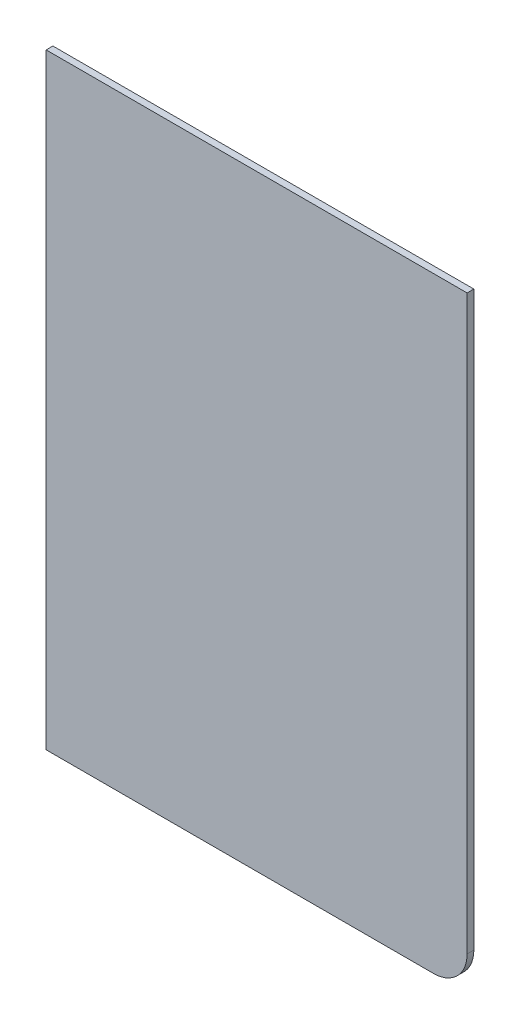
ISO-10303-21;
HEADER;
FILE_DESCRIPTION(('STEP AP214'),'2;1');
FILE_NAME('part.step','',(''),(''),'','','');
FILE_SCHEMA(('AUTOMOTIVE_DESIGN { 1 0 10303 214 1 1 1 1 }'));
ENDSEC;
DATA;
#1=APPLICATION_CONTEXT('core data for automotive mechanical design processes');
#2=APPLICATION_PROTOCOL_DEFINITION('international standard','automotive_design',2000,#1);
#3=PRODUCT_CONTEXT('',#1,'mechanical');
#4=PRODUCT('Part','Part','',(#3));
#5=PRODUCT_RELATED_PRODUCT_CATEGORY('part','',(#4));
#6=PRODUCT_DEFINITION_FORMATION('','',#4);
#7=PRODUCT_DEFINITION_CONTEXT('part definition',#1,'design');
#8=PRODUCT_DEFINITION('design','',#6,#7);
#9=PRODUCT_DEFINITION_SHAPE('','',#8);
#10=(LENGTH_UNIT() NAMED_UNIT(*) SI_UNIT(.MILLI.,.METRE.));
#11=(NAMED_UNIT(*) PLANE_ANGLE_UNIT() SI_UNIT($,.RADIAN.));
#12=(NAMED_UNIT(*) SI_UNIT($,.STERADIAN.) SOLID_ANGLE_UNIT());
#13=UNCERTAINTY_MEASURE_WITH_UNIT(LENGTH_MEASURE(1.E-05),#10,'distance_accuracy_value','');
#14=(GEOMETRIC_REPRESENTATION_CONTEXT(3) GLOBAL_UNCERTAINTY_ASSIGNED_CONTEXT((#13)) GLOBAL_UNIT_ASSIGNED_CONTEXT((#10,
#11,#12)) REPRESENTATION_CONTEXT('',''));
#15=CARTESIAN_POINT('',(0.,0.,0.));
#16=DIRECTION('',(0.,0.,1.));
#17=DIRECTION('',(1.,0.,0.));
#18=AXIS2_PLACEMENT_3D('',#15,#16,#17);
#19=CARTESIAN_POINT('',(0.,0.,2.));
#20=DIRECTION('',(1.,0.,0.));
#21=DIRECTION('',(0.,1.,0.));
#22=AXIS2_PLACEMENT_3D('',#19,#20,#21);
#23=PLANE('',#22);
#24=DIRECTION('',(0.,-1.,0.));
#25=VECTOR('',#24,1.);
#26=CARTESIAN_POINT('',(0.,0.,0.));
#27=LINE('',#26,#25);
#28=CARTESIAN_POINT('',(0.,180.,0.));
#29=VERTEX_POINT('',#28);
#30=CARTESIAN_POINT('',(0.,0.,0.));
#31=VERTEX_POINT('',#30);
#32=EDGE_CURVE('E97',#29,#31,#27,.T.);
#33=ORIENTED_EDGE('',*,*,#32,.T.);
#34=DIRECTION('',(0.,0.,-1.));
#35=VECTOR('',#34,1.);
#36=CARTESIAN_POINT('',(0.,0.,2.));
#37=LINE('',#36,#35);
#38=CARTESIAN_POINT('',(0.,0.,2.));
#39=VERTEX_POINT('',#38);
#40=EDGE_CURVE('E80',#39,#31,#37,.T.);
#41=ORIENTED_EDGE('',*,*,#40,.F.);
#42=DIRECTION('',(0.,-1.,0.));
#43=VECTOR('',#42,1.);
#44=CARTESIAN_POINT('',(0.,0.,2.));
#45=LINE('',#44,#43);
#46=CARTESIAN_POINT('',(0.,180.,2.));
#47=VERTEX_POINT('',#46);
#48=EDGE_CURVE('E85',#47,#39,#45,.T.);
#49=ORIENTED_EDGE('',*,*,#48,.F.);
#50=DIRECTION('',(0.,0.,-1.));
#51=VECTOR('',#50,1.);
#52=CARTESIAN_POINT('',(0.,180.,2.));
#53=LINE('',#52,#51);
#54=EDGE_CURVE('E104',#47,#29,#53,.T.);
#55=ORIENTED_EDGE('',*,*,#54,.T.);
#56=EDGE_LOOP('',(#33,#41,#49,#55));
#57=FACE_BOUND('',#56,.T.);
#58=ADVANCED_FACE('F33',(#57),#23,.F.);
#59=CARTESIAN_POINT('',(0.,0.,2.));
#60=DIRECTION('',(0.,1.,0.));
#61=DIRECTION('',(0.,0.,1.));
#62=AXIS2_PLACEMENT_3D('',#59,#60,#61);
#63=PLANE('',#62);
#64=DIRECTION('',(1.,0.,0.));
#65=VECTOR('',#64,1.);
#66=CARTESIAN_POINT('',(0.,0.,0.));
#67=LINE('',#66,#65);
#68=CARTESIAN_POINT('',(115.,0.,0.));
#69=VERTEX_POINT('',#68);
#70=EDGE_CURVE('E112',#31,#69,#67,.T.);
#71=ORIENTED_EDGE('',*,*,#70,.T.);
#72=DIRECTION('',(0.,0.,-1.));
#73=VECTOR('',#72,1.);
#74=CARTESIAN_POINT('',(115.,0.,2.));
#75=LINE('',#74,#73);
#76=CARTESIAN_POINT('',(115.,0.,2.));
#77=VERTEX_POINT('',#76);
#78=EDGE_CURVE('E41',#69,#77,#75,.F.);
#79=ORIENTED_EDGE('',*,*,#78,.T.);
#80=DIRECTION('',(1.,0.,0.));
#81=VECTOR('',#80,1.);
#82=CARTESIAN_POINT('',(0.,0.,2.));
#83=LINE('',#82,#81);
#84=EDGE_CURVE('E76',#39,#77,#83,.T.);
#85=ORIENTED_EDGE('',*,*,#84,.F.);
#86=ORIENTED_EDGE('',*,*,#40,.T.);
#87=EDGE_LOOP('',(#71,#79,#85,#86));
#88=FACE_BOUND('',#87,.T.);
#89=ADVANCED_FACE('F78',(#88),#63,.F.);
#90=CARTESIAN_POINT('',(125.,0.,2.));
#91=DIRECTION('',(-1.,0.,0.));
#92=DIRECTION('',(0.,-1.,0.));
#93=AXIS2_PLACEMENT_3D('',#90,#91,#92);
#94=PLANE('',#93);
#95=DIRECTION('',(0.,1.,0.));
#96=VECTOR('',#95,1.);
#97=CARTESIAN_POINT('',(125.,0.,2.));
#98=LINE('',#97,#96);
#99=CARTESIAN_POINT('',(125.,10.,2.));
#100=VERTEX_POINT('',#99);
#101=CARTESIAN_POINT('',(125.,180.,2.));
#102=VERTEX_POINT('',#101);
#103=EDGE_CURVE('E84',#100,#102,#98,.T.);
#104=ORIENTED_EDGE('',*,*,#103,.F.);
#105=DIRECTION('',(0.,0.,-1.));
#106=VECTOR('',#105,1.);
#107=CARTESIAN_POINT('',(125.,10.,2.));
#108=LINE('',#107,#106);
#109=CARTESIAN_POINT('',(125.,10.,0.));
#110=VERTEX_POINT('',#109);
#111=EDGE_CURVE('E98',#100,#110,#108,.T.);
#112=ORIENTED_EDGE('',*,*,#111,.T.);
#113=DIRECTION('',(0.,1.,0.));
#114=VECTOR('',#113,1.);
#115=CARTESIAN_POINT('',(125.,0.,0.));
#116=LINE('',#115,#114);
#117=CARTESIAN_POINT('',(125.,180.,0.));
#118=VERTEX_POINT('',#117);
#119=EDGE_CURVE('E110',#110,#118,#116,.T.);
#120=ORIENTED_EDGE('',*,*,#119,.T.);
#121=DIRECTION('',(0.,0.,-1.));
#122=VECTOR('',#121,1.);
#123=CARTESIAN_POINT('',(125.,180.,2.));
#124=LINE('',#123,#122);
#125=EDGE_CURVE('E99',#102,#118,#124,.T.);
#126=ORIENTED_EDGE('',*,*,#125,.F.);
#127=EDGE_LOOP('',(#104,#112,#120,#126));
#128=FACE_BOUND('',#127,.T.);
#129=ADVANCED_FACE('F120',(#128),#94,.F.);
#130=CARTESIAN_POINT('',(0.,180.,2.));
#131=DIRECTION('',(0.,-1.,0.));
#132=DIRECTION('',(0.,0.,-1.));
#133=AXIS2_PLACEMENT_3D('',#130,#131,#132);
#134=PLANE('',#133);
#135=DIRECTION('',(-1.,0.,0.));
#136=VECTOR('',#135,1.);
#137=CARTESIAN_POINT('',(0.,180.,0.));
#138=LINE('',#137,#136);
#139=EDGE_CURVE('E94',#118,#29,#138,.T.);
#140=ORIENTED_EDGE('',*,*,#139,.T.);
#141=ORIENTED_EDGE('',*,*,#54,.F.);
#142=DIRECTION('',(-1.,0.,0.));
#143=VECTOR('',#142,1.);
#144=CARTESIAN_POINT('',(0.,180.,2.));
#145=LINE('',#144,#143);
#146=EDGE_CURVE('E90',#102,#47,#145,.T.);
#147=ORIENTED_EDGE('',*,*,#146,.F.);
#148=ORIENTED_EDGE('',*,*,#125,.T.);
#149=EDGE_LOOP('',(#140,#141,#147,#148));
#150=FACE_BOUND('',#149,.T.);
#151=ADVANCED_FACE('F123',(#150),#134,.F.);
#152=CARTESIAN_POINT('',(0.,180.,2.));
#153=DIRECTION('',(0.,0.,-1.));
#154=DIRECTION('',(-1.,0.,0.));
#155=AXIS2_PLACEMENT_3D('',#152,#153,#154);
#156=PLANE('',#155);
#157=ORIENTED_EDGE('',*,*,#84,.T.);
#158=CARTESIAN_POINT('',(115.,10.,2.));
#159=DIRECTION('',(0.,0.,-1.));
#160=DIRECTION('',(-1.,0.,0.));
#161=AXIS2_PLACEMENT_3D('',#158,#159,#160);
#162=CIRCLE('',#161,10.);
#163=EDGE_CURVE('E11',#77,#100,#162,.F.);
#164=ORIENTED_EDGE('',*,*,#163,.T.);
#165=ORIENTED_EDGE('',*,*,#103,.T.);
#166=ORIENTED_EDGE('',*,*,#146,.T.);
#167=ORIENTED_EDGE('',*,*,#48,.T.);
#168=EDGE_LOOP('',(#157,#164,#165,#166,#167));
#169=FACE_BOUND('',#168,.T.);
#170=ADVANCED_FACE('F88',(#169),#156,.F.);
#171=CARTESIAN_POINT('',(0.,180.,0.));
#172=DIRECTION('',(0.,0.,-1.));
#173=DIRECTION('',(-1.,0.,0.));
#174=AXIS2_PLACEMENT_3D('',#171,#172,#173);
#175=PLANE('',#174);
#176=ORIENTED_EDGE('',*,*,#119,.F.);
#177=CARTESIAN_POINT('',(115.,10.,0.));
#178=DIRECTION('',(0.,0.,-1.));
#179=DIRECTION('',(-1.,0.,0.));
#180=AXIS2_PLACEMENT_3D('',#177,#178,#179);
#181=CIRCLE('',#180,10.);
#182=EDGE_CURVE('E55',#110,#69,#181,.T.);
#183=ORIENTED_EDGE('',*,*,#182,.T.);
#184=ORIENTED_EDGE('',*,*,#70,.F.);
#185=ORIENTED_EDGE('',*,*,#32,.F.);
#186=ORIENTED_EDGE('',*,*,#139,.F.);
#187=EDGE_LOOP('',(#176,#183,#184,#185,#186));
#188=FACE_BOUND('',#187,.T.);
#189=ADVANCED_FACE('F124',(#188),#175,.T.);
#190=CARTESIAN_POINT('',(115.,10.,2.));
#191=DIRECTION('',(0.,0.,-1.));
#192=DIRECTION('',(-1.,0.,0.));
#193=AXIS2_PLACEMENT_3D('',#190,#191,#192);
#194=CYLINDRICAL_SURFACE('',#193,10.);
#195=ORIENTED_EDGE('',*,*,#163,.F.);
#196=ORIENTED_EDGE('',*,*,#78,.F.);
#197=ORIENTED_EDGE('',*,*,#182,.F.);
#198=ORIENTED_EDGE('',*,*,#111,.F.);
#199=EDGE_LOOP('',(#195,#196,#197,#198));
#200=FACE_BOUND('',#199,.T.);
#201=ADVANCED_FACE('F35',(#200),#194,.T.);
#202=CLOSED_SHELL('',(#58,#89,#129,#151,#170,#189,#201));
#203=MANIFOLD_SOLID_BREP('B2',#202);
#204=ADVANCED_BREP_SHAPE_REPRESENTATION('',(#18,#203),#14);
#205=SHAPE_DEFINITION_REPRESENTATION(#9,#204);
ENDSEC;
END-ISO-10303-21;
